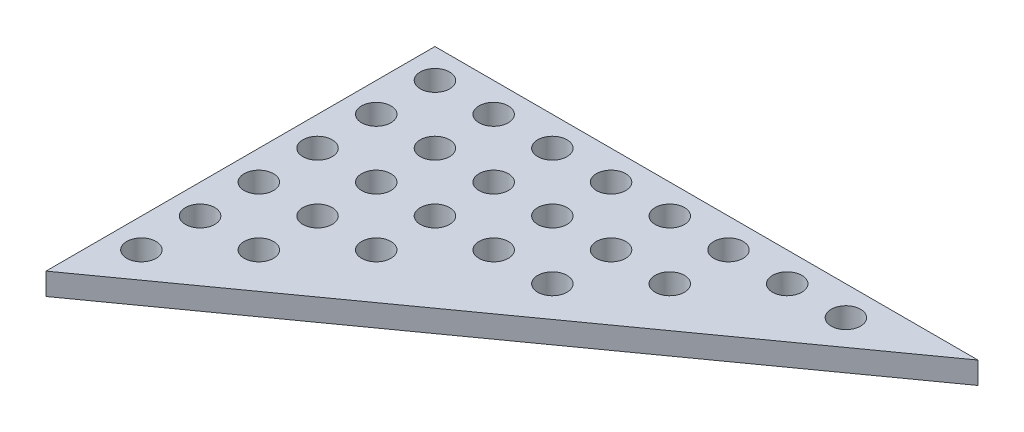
from build123d import *

# Parameters (mm, degrees)
SKETCH_2_R      = 2
EXTRUDE_2_DEPTH = 3


with BuildPart() as part:
    # Sketch 2 → Extrude 2 (new body)
    with BuildSketch(Plane(origin=(0, 0, 0), x_dir=(1, 0, 0), z_dir=(0, 1, 0))):
        Polygon((-61.94375, 34.946875), (-61.94375, -18.053125), (12.05625, 34.946875), align=None)
        with Locations(Location((-57.94375, 30.946875, 0), (0, 0, 270))):
            Circle(SKETCH_2_R, mode=Mode.SUBTRACT)
        with Locations(Location((-49.94375, 30.946875, 0), (0, 0, 270))):
            Circle(SKETCH_2_R, mode=Mode.SUBTRACT)
        with Locations(Location((-41.94375, 30.946875, 0), (0, 0, 270))):
            Circle(SKETCH_2_R, mode=Mode.SUBTRACT)
        with Locations(Location((-33.94375, 30.946875, 0), (0, 0, 270))):
            Circle(SKETCH_2_R, mode=Mode.SUBTRACT)
        with Locations(Location((-25.94375, 30.946875, 0), (0, 0, 270))):
            Circle(SKETCH_2_R, mode=Mode.SUBTRACT)
        with Locations(Location((-17.94375, 30.946875, 0), (0, 0, 270))):
            Circle(SKETCH_2_R, mode=Mode.SUBTRACT)
        with Locations(Location((-9.94375, 30.946875, 0), (0, 0, 270))):
            Circle(SKETCH_2_R, mode=Mode.SUBTRACT)
        with Locations(Location((-1.94375, 30.946875, 0), (0, 0, 270))):
            Circle(SKETCH_2_R, mode=Mode.SUBTRACT)
        with Locations(Location((-57.94375, 22.946875, 0), (0, 0, 270))):
            Circle(SKETCH_2_R, mode=Mode.SUBTRACT)
        with Locations(Location((-57.94375, 14.946875, 0), (0, 0, 270))):
            Circle(SKETCH_2_R, mode=Mode.SUBTRACT)
        with Locations(Location((-57.94375, 6.946875, 0), (0, 0, 270))):
            Circle(SKETCH_2_R, mode=Mode.SUBTRACT)
        with Locations(Location((-57.94375, -1.053125, 0), (0, 0, 270))):
            Circle(SKETCH_2_R, mode=Mode.SUBTRACT)
        with Locations(Location((-57.94375, -9.053125, 0), (0, 0, 270))):
            Circle(SKETCH_2_R, mode=Mode.SUBTRACT)
        with Locations(Location((-49.94375, 22.946875, 0), (0, 0, 270))):
            Circle(SKETCH_2_R, mode=Mode.SUBTRACT)
        with Locations(Location((-41.94375, 22.946875, 0), (0, 0, 270))):
            Circle(SKETCH_2_R, mode=Mode.SUBTRACT)
        with Locations(Location((-33.94375, 22.946875, 0), (0, 0, 270))):
            Circle(SKETCH_2_R, mode=Mode.SUBTRACT)
        with Locations(Location((-25.94375, 22.946875, 0), (0, 0, 270))):
            Circle(SKETCH_2_R, mode=Mode.SUBTRACT)
        with Locations(Location((-17.94375, 22.946875, 0), (0, 0, 270))):
            Circle(SKETCH_2_R, mode=Mode.SUBTRACT)
        with Locations(Location((-49.94375, 14.946875, 0), (0, 0, 270))):
            Circle(SKETCH_2_R, mode=Mode.SUBTRACT)
        with Locations(Location((-41.94375, 14.946875, 0), (0, 0, 270))):
            Circle(SKETCH_2_R, mode=Mode.SUBTRACT)
        with Locations(Location((-49.94375, 6.946875, 0), (0, 0, 270))):
            Circle(SKETCH_2_R, mode=Mode.SUBTRACT)
        with Locations(Location((-41.94375, 6.946875, 0), (0, 0, 270))):
            Circle(SKETCH_2_R, mode=Mode.SUBTRACT)
        with Locations(Location((-49.94375, -1.053125, 0), (0, 0, 270))):
            Circle(SKETCH_2_R, mode=Mode.SUBTRACT)
        with Locations(Location((-33.94375, 14.946875, 0), (0, 0, 270))):
            Circle(SKETCH_2_R, mode=Mode.SUBTRACT)
        with Locations(Location((-25.94375, 14.946875, 0), (0, 0, 270))):
            Circle(SKETCH_2_R, mode=Mode.SUBTRACT)
    extrude(amount=EXTRUDE_2_DEPTH)


solid = part.part
